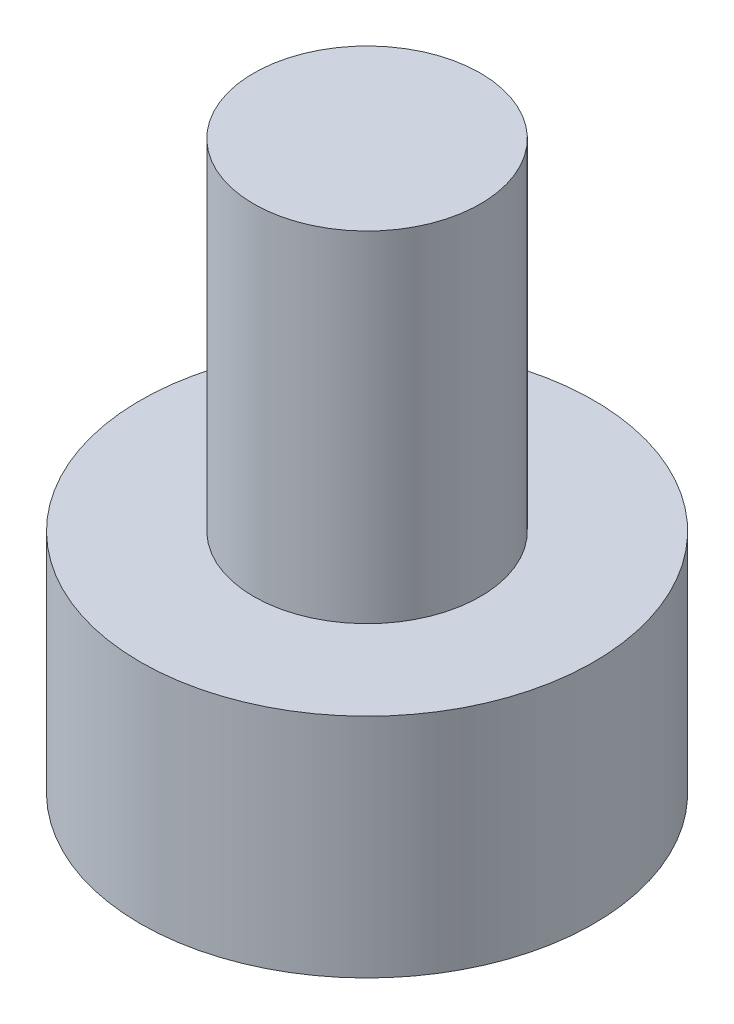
ISO-10303-21;
HEADER;
FILE_DESCRIPTION(('STEP AP214'),'2;1');
FILE_NAME('part.step','',(''),(''),'','','');
FILE_SCHEMA(('AUTOMOTIVE_DESIGN { 1 0 10303 214 1 1 1 1 }'));
ENDSEC;
DATA;
#1=APPLICATION_CONTEXT('core data for automotive mechanical design processes');
#2=APPLICATION_PROTOCOL_DEFINITION('international standard','automotive_design',2000,#1);
#3=PRODUCT_CONTEXT('',#1,'mechanical');
#4=PRODUCT('Part','Part','',(#3));
#5=PRODUCT_RELATED_PRODUCT_CATEGORY('part','',(#4));
#6=PRODUCT_DEFINITION_FORMATION('','',#4);
#7=PRODUCT_DEFINITION_CONTEXT('part definition',#1,'design');
#8=PRODUCT_DEFINITION('design','',#6,#7);
#9=PRODUCT_DEFINITION_SHAPE('','',#8);
#10=(LENGTH_UNIT() NAMED_UNIT(*) SI_UNIT(.MILLI.,.METRE.));
#11=(NAMED_UNIT(*) PLANE_ANGLE_UNIT() SI_UNIT($,.RADIAN.));
#12=(NAMED_UNIT(*) SI_UNIT($,.STERADIAN.) SOLID_ANGLE_UNIT());
#13=UNCERTAINTY_MEASURE_WITH_UNIT(LENGTH_MEASURE(1.E-05),#10,'distance_accuracy_value','');
#14=(GEOMETRIC_REPRESENTATION_CONTEXT(3) GLOBAL_UNCERTAINTY_ASSIGNED_CONTEXT((#13)) GLOBAL_UNIT_ASSIGNED_CONTEXT((#10,
#11,#12)) REPRESENTATION_CONTEXT('',''));
#15=CARTESIAN_POINT('',(0.,0.,0.));
#16=DIRECTION('',(0.,0.,1.));
#17=DIRECTION('',(1.,0.,0.));
#18=AXIS2_PLACEMENT_3D('',#15,#16,#17);
#19=CARTESIAN_POINT('',(0.,8.,0.));
#20=DIRECTION('',(0.,-1.,0.));
#21=DIRECTION('',(0.,0.,-1.));
#22=AXIS2_PLACEMENT_3D('',#19,#20,#21);
#23=CYLINDRICAL_SURFACE('',#22,8.);
#24=CARTESIAN_POINT('',(0.,8.,0.));
#25=DIRECTION('',(0.,1.,0.));
#26=DIRECTION('',(0.,0.,1.));
#27=AXIS2_PLACEMENT_3D('',#24,#25,#26);
#28=CIRCLE('',#27,8.);
#29=CARTESIAN_POINT('',(0.,8.,8.));
#30=VERTEX_POINT('',#29);
#31=EDGE_CURVE('E10',#30,#30,#28,.T.);
#32=ORIENTED_EDGE('',*,*,#31,.F.);
#33=EDGE_LOOP('',(#32));
#34=FACE_BOUND('',#33,.T.);
#35=CARTESIAN_POINT('',(0.,0.,0.));
#36=DIRECTION('',(0.,1.,0.));
#37=DIRECTION('',(0.,0.,1.));
#38=AXIS2_PLACEMENT_3D('',#35,#36,#37);
#39=CIRCLE('',#38,8.);
#40=CARTESIAN_POINT('',(0.,0.,8.));
#41=VERTEX_POINT('',#40);
#42=EDGE_CURVE('E34',#41,#41,#39,.T.);
#43=ORIENTED_EDGE('',*,*,#42,.T.);
#44=EDGE_LOOP('',(#43));
#45=FACE_BOUND('',#44,.T.);
#46=ADVANCED_FACE('F31',(#34,#45),#23,.T.);
#47=CARTESIAN_POINT('',(0.,8.,0.));
#48=DIRECTION('',(0.,1.,0.));
#49=DIRECTION('',(0.,0.,1.));
#50=AXIS2_PLACEMENT_3D('',#47,#48,#49);
#51=PLANE('',#50);
#52=CARTESIAN_POINT('',(0.,8.,0.));
#53=DIRECTION('',(0.,1.,0.));
#54=DIRECTION('',(0.,0.,1.));
#55=AXIS2_PLACEMENT_3D('',#52,#53,#54);
#56=CIRCLE('',#55,4.);
#57=CARTESIAN_POINT('',(0.,8.,4.));
#58=VERTEX_POINT('',#57);
#59=EDGE_CURVE('E43',#58,#58,#56,.T.);
#60=ORIENTED_EDGE('',*,*,#59,.F.);
#61=EDGE_LOOP('',(#60));
#62=FACE_BOUND('',#61,.T.);
#63=ORIENTED_EDGE('',*,*,#31,.T.);
#64=EDGE_LOOP('',(#63));
#65=FACE_BOUND('',#64,.T.);
#66=ADVANCED_FACE('F58',(#62,#65),#51,.T.);
#67=CARTESIAN_POINT('',(0.,0.,0.));
#68=DIRECTION('',(0.,1.,0.));
#69=DIRECTION('',(0.,0.,1.));
#70=AXIS2_PLACEMENT_3D('',#67,#68,#69);
#71=PLANE('',#70);
#72=ORIENTED_EDGE('',*,*,#42,.F.);
#73=EDGE_LOOP('',(#72));
#74=FACE_BOUND('',#73,.T.);
#75=ADVANCED_FACE('F54',(#74),#71,.F.);
#76=CARTESIAN_POINT('',(0.,20.,0.));
#77=DIRECTION('',(0.,-1.,0.));
#78=DIRECTION('',(0.,0.,-1.));
#79=AXIS2_PLACEMENT_3D('',#76,#77,#78);
#80=CYLINDRICAL_SURFACE('',#79,4.);
#81=CARTESIAN_POINT('',(0.,20.,0.));
#82=DIRECTION('',(0.,1.,0.));
#83=DIRECTION('',(0.,0.,1.));
#84=AXIS2_PLACEMENT_3D('',#81,#82,#83);
#85=CIRCLE('',#84,4.);
#86=CARTESIAN_POINT('',(0.,20.,4.));
#87=VERTEX_POINT('',#86);
#88=EDGE_CURVE('E41',#87,#87,#85,.T.);
#89=ORIENTED_EDGE('',*,*,#88,.F.);
#90=EDGE_LOOP('',(#89));
#91=FACE_BOUND('',#90,.T.);
#92=ORIENTED_EDGE('',*,*,#59,.T.);
#93=EDGE_LOOP('',(#92));
#94=FACE_BOUND('',#93,.T.);
#95=ADVANCED_FACE('F51',(#91,#94),#80,.T.);
#96=CARTESIAN_POINT('',(0.,20.,0.));
#97=DIRECTION('',(0.,1.,0.));
#98=DIRECTION('',(0.,0.,1.));
#99=AXIS2_PLACEMENT_3D('',#96,#97,#98);
#100=PLANE('',#99);
#101=ORIENTED_EDGE('',*,*,#88,.T.);
#102=EDGE_LOOP('',(#101));
#103=FACE_BOUND('',#102,.T.);
#104=ADVANCED_FACE('F49',(#103),#100,.T.);
#105=CLOSED_SHELL('',(#46,#66,#75,#95,#104));
#106=MANIFOLD_SOLID_BREP('B2',#105);
#107=ADVANCED_BREP_SHAPE_REPRESENTATION('',(#18,#106),#14);
#108=SHAPE_DEFINITION_REPRESENTATION(#9,#107);
ENDSEC;
END-ISO-10303-21;
